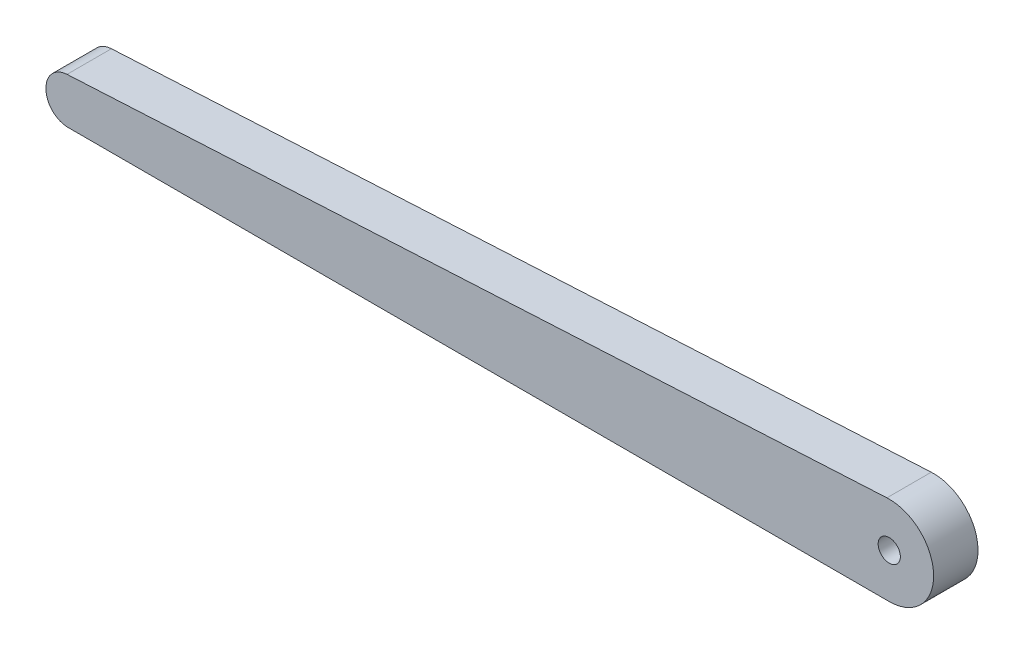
from build123d import *

# Parameters (mm, degrees)
ESQUISSE1_R        = 0.5
BOSS_EXTRU_1_DEPTH = 1


with BuildPart() as part:
    # Esquisse1 → Boss.-Extru.1 (new, symmetric)
    with BuildSketch(Plane.XY):
        with BuildLine():
            Line((0, -2), (-37, -2))
            ThreePointArc((-37, -2), (-37.707106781, -1.707106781), (-38, -1))
            Line((-38, -1), (-38, -0.948683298))
            ThreePointArc((-38, -0.948683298), (-37.72547625, -0.260436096), (-37.052631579, 0.0499307))
            Line((-37.052631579, 0.0499307), (-0.105263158, 1.997227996))
            ThreePointArc((-0.105263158, 1.997227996), (1.999306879, 0.052649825), (0, -2))
        make_face()
        Circle(ESQUISSE1_R, mode=Mode.SUBTRACT)
    extrude(amount=BOSS_EXTRU_1_DEPTH, both=True)


solid = part.part
